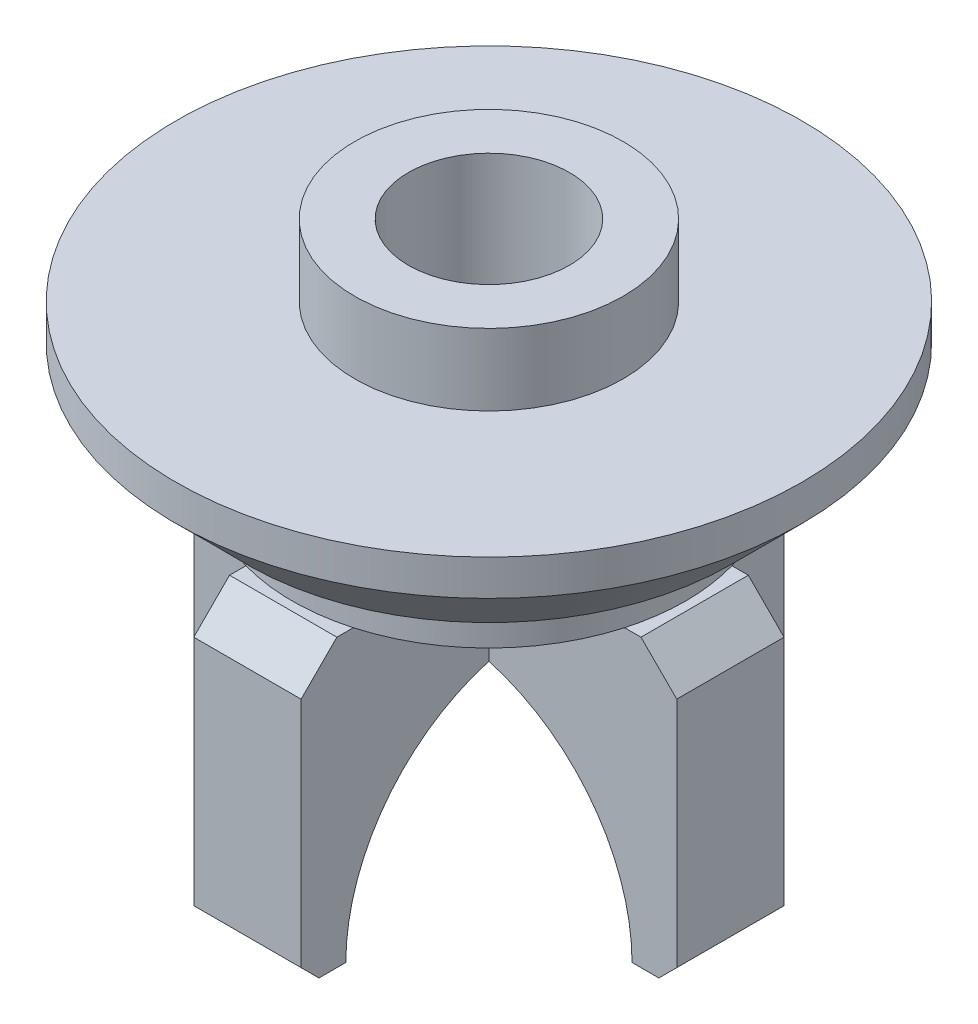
ISO-10303-21;
HEADER;
FILE_DESCRIPTION(('STEP AP214'),'2;1');
FILE_NAME('part.step','',(''),(''),'','','');
FILE_SCHEMA(('AUTOMOTIVE_DESIGN { 1 0 10303 214 1 1 1 1 }'));
ENDSEC;
DATA;
#1=APPLICATION_CONTEXT('core data for automotive mechanical design processes');
#2=APPLICATION_PROTOCOL_DEFINITION('international standard','automotive_design',2000,#1);
#3=PRODUCT_CONTEXT('',#1,'mechanical');
#4=PRODUCT('Part','Part','',(#3));
#5=PRODUCT_RELATED_PRODUCT_CATEGORY('part','',(#4));
#6=PRODUCT_DEFINITION_FORMATION('','',#4);
#7=PRODUCT_DEFINITION_CONTEXT('part definition',#1,'design');
#8=PRODUCT_DEFINITION('design','',#6,#7);
#9=PRODUCT_DEFINITION_SHAPE('','',#8);
#10=(LENGTH_UNIT() NAMED_UNIT(*) SI_UNIT(.MILLI.,.METRE.));
#11=(NAMED_UNIT(*) PLANE_ANGLE_UNIT() SI_UNIT($,.RADIAN.));
#12=(NAMED_UNIT(*) SI_UNIT($,.STERADIAN.) SOLID_ANGLE_UNIT());
#13=UNCERTAINTY_MEASURE_WITH_UNIT(LENGTH_MEASURE(1.E-05),#10,'distance_accuracy_value','');
#14=(GEOMETRIC_REPRESENTATION_CONTEXT(3) GLOBAL_UNCERTAINTY_ASSIGNED_CONTEXT((#13)) GLOBAL_UNIT_ASSIGNED_CONTEXT((#10,
#11,#12)) REPRESENTATION_CONTEXT('',''));
#15=CARTESIAN_POINT('',(0.,0.,0.));
#16=DIRECTION('',(0.,0.,1.));
#17=DIRECTION('',(1.,0.,0.));
#18=AXIS2_PLACEMENT_3D('',#15,#16,#17);
#19=CARTESIAN_POINT('',(0.,0.,0.));
#20=DIRECTION('',(0.,-1.,0.));
#21=DIRECTION('',(1.,0.,0.));
#22=AXIS2_PLACEMENT_3D('',#19,#20,#21);
#23=PLANE('',#22);
#24=CARTESIAN_POINT('',(0.,0.,0.));
#25=DIRECTION('',(0.,-1.,0.));
#26=DIRECTION('',(1.,0.,0.));
#27=AXIS2_PLACEMENT_3D('',#24,#25,#26);
#28=CIRCLE('',#27,11.);
#29=CARTESIAN_POINT('',(10.5830052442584,0.,3.));
#30=VERTEX_POINT('',#29);
#31=CARTESIAN_POINT('',(2.99999999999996,0.,10.5830052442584));
#32=VERTEX_POINT('',#31);
#33=EDGE_CURVE('E444',#30,#32,#28,.T.);
#34=ORIENTED_EDGE('',*,*,#33,.T.);
#35=DIRECTION('',(0.,0.,1.));
#36=VECTOR('',#35,1.);
#37=CARTESIAN_POINT('',(3.,0.,0.));
#38=LINE('',#37,#36);
#39=CARTESIAN_POINT('',(2.99999999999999,0.,3.));
#40=VERTEX_POINT('',#39);
#41=EDGE_CURVE('E493',#40,#32,#38,.T.);
#42=ORIENTED_EDGE('',*,*,#41,.F.);
#43=DIRECTION('',(1.,0.,0.));
#44=VECTOR('',#43,1.);
#45=CARTESIAN_POINT('',(0.,0.,3.));
#46=LINE('',#45,#44);
#47=EDGE_CURVE('E361',#40,#30,#46,.T.);
#48=ORIENTED_EDGE('',*,*,#47,.T.);
#49=EDGE_LOOP('',(#34,#42,#48));
#50=FACE_BOUND('',#49,.T.);
#51=ADVANCED_FACE('F38',(#50),#23,.T.);
#52=DIRECTION('',(1.,0.,0.));
#53=VECTOR('',#52,1.);
#54=CARTESIAN_POINT('',(0.,0.,-3.));
#55=LINE('',#54,#53);
#56=CARTESIAN_POINT('',(3.00000000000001,0.,-3.));
#57=VERTEX_POINT('',#56);
#58=CARTESIAN_POINT('',(10.5830052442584,0.,-3.));
#59=VERTEX_POINT('',#58);
#60=EDGE_CURVE('E390',#57,#59,#55,.T.);
#61=ORIENTED_EDGE('',*,*,#60,.F.);
#62=CARTESIAN_POINT('',(3.00000000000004,0.,-10.5830052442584));
#63=VERTEX_POINT('',#62);
#64=EDGE_CURVE('E61',#63,#57,#38,.T.);
#65=ORIENTED_EDGE('',*,*,#64,.F.);
#66=EDGE_CURVE('E447',#63,#59,#28,.T.);
#67=ORIENTED_EDGE('',*,*,#66,.T.);
#68=EDGE_LOOP('',(#61,#65,#67));
#69=FACE_BOUND('',#68,.T.);
#70=ADVANCED_FACE('F489',(#69),#23,.T.);
#71=CARTESIAN_POINT('',(0.,-16.,3.));
#72=DIRECTION('',(0.,0.,-1.));
#73=DIRECTION('',(-1.,0.,0.));
#74=AXIS2_PLACEMENT_3D('',#71,#72,#73);
#75=CYLINDRICAL_SURFACE('',#74,11.);
#76=CARTESIAN_POINT('',(0.,-16.,0.));
#77=DIRECTION('',(0.707106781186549,0.,-0.707106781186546));
#78=DIRECTION('',(-0.707106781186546,0.,-0.707106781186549));
#79=AXIS2_PLACEMENT_3D('',#76,#77,#78);
#80=ELLIPSE('',#79,15.5563491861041,11.);
#81=CARTESIAN_POINT('',(0.,-5.,0.));
#82=VERTEX_POINT('',#81);
#83=CARTESIAN_POINT('',(2.99999999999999,-5.41699475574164,3.));
#84=VERTEX_POINT('',#83);
#85=EDGE_CURVE('E336',#82,#84,#80,.T.);
#86=ORIENTED_EDGE('',*,*,#85,.F.);
#87=CARTESIAN_POINT('',(0.,-16.,0.));
#88=DIRECTION('',(-0.707106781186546,0.,-0.707106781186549));
#89=DIRECTION('',(0.707106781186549,0.,-0.707106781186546));
#90=AXIS2_PLACEMENT_3D('',#87,#88,#89);
#91=ELLIPSE('',#90,15.556349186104,11.);
#92=CARTESIAN_POINT('',(3.00000000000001,-5.41699475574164,-3.));
#93=VERTEX_POINT('',#92);
#94=EDGE_CURVE('E332',#93,#82,#91,.F.);
#95=ORIENTED_EDGE('',*,*,#94,.F.);
#96=CARTESIAN_POINT('',(0.,-16.,-3.));
#97=DIRECTION('',(0.,0.,1.));
#98=DIRECTION('',(1.,0.,0.));
#99=AXIS2_PLACEMENT_3D('',#96,#97,#98);
#100=CIRCLE('',#99,11.);
#101=CARTESIAN_POINT('',(11.,-16.,-3.));
#102=VERTEX_POINT('',#101);
#103=EDGE_CURVE('E372',#102,#93,#100,.T.);
#104=ORIENTED_EDGE('',*,*,#103,.F.);
#105=DIRECTION('',(0.,0.,-1.));
#106=VECTOR('',#105,1.);
#107=CARTESIAN_POINT('',(11.,-16.,3.));
#108=LINE('',#107,#106);
#109=CARTESIAN_POINT('',(11.,-16.,3.));
#110=VERTEX_POINT('',#109);
#111=EDGE_CURVE('E423',#110,#102,#108,.T.);
#112=ORIENTED_EDGE('',*,*,#111,.F.);
#113=CARTESIAN_POINT('',(0.,-16.,3.));
#114=DIRECTION('',(0.,0.,1.));
#115=DIRECTION('',(1.,0.,0.));
#116=AXIS2_PLACEMENT_3D('',#113,#114,#115);
#117=CIRCLE('',#116,11.);
#118=EDGE_CURVE('E342',#110,#84,#117,.T.);
#119=ORIENTED_EDGE('',*,*,#118,.T.);
#120=EDGE_LOOP('',(#86,#95,#104,#112,#119));
#121=FACE_BOUND('',#120,.T.);
#122=ADVANCED_FACE('F487',(#121),#75,.F.);
#123=CARTESIAN_POINT('',(0.,0.,3.));
#124=DIRECTION('',(0.,0.,1.));
#125=DIRECTION('',(1.,0.,0.));
#126=AXIS2_PLACEMENT_3D('',#123,#124,#125);
#127=PLANE('',#126);
#128=ORIENTED_EDGE('',*,*,#47,.F.);
#129=DIRECTION('',(0.,-1.,0.));
#130=VECTOR('',#129,1.);
#131=CARTESIAN_POINT('',(2.99999999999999,0.,3.));
#132=LINE('',#131,#130);
#133=EDGE_CURVE('E324',#40,#84,#132,.T.);
#134=ORIENTED_EDGE('',*,*,#133,.T.);
#135=ORIENTED_EDGE('',*,*,#118,.F.);
#136=DIRECTION('',(1.,0.,0.));
#137=VECTOR('',#136,1.);
#138=CARTESIAN_POINT('',(0.,-16.,3.));
#139=LINE('',#138,#137);
#140=CARTESIAN_POINT('',(12.5,-16.,3.));
#141=VERTEX_POINT('',#140);
#142=EDGE_CURVE('E345',#110,#141,#139,.T.);
#143=ORIENTED_EDGE('',*,*,#142,.T.);
#144=DIRECTION('',(0.707106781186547,0.707106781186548,0.));
#145=VECTOR('',#144,1.);
#146=CARTESIAN_POINT('',(14.25,-14.25,3.));
#147=LINE('',#146,#145);
#148=CARTESIAN_POINT('',(13.5,-15.,3.));
#149=VERTEX_POINT('',#148);
#150=EDGE_CURVE('E348',#141,#149,#147,.T.);
#151=ORIENTED_EDGE('',*,*,#150,.T.);
#152=DIRECTION('',(0.,-1.,0.));
#153=VECTOR('',#152,1.);
#154=CARTESIAN_POINT('',(13.5,0.,3.));
#155=LINE('',#154,#153);
#156=CARTESIAN_POINT('',(13.5,-2.,3.));
#157=VERTEX_POINT('',#156);
#158=EDGE_CURVE('E350',#157,#149,#155,.T.);
#159=ORIENTED_EDGE('',*,*,#158,.F.);
#160=DIRECTION('',(0.707106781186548,-0.707106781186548,0.));
#161=VECTOR('',#160,1.);
#162=CARTESIAN_POINT('',(5.75,5.75,3.));
#163=LINE('',#162,#161);
#164=CARTESIAN_POINT('',(11.5,0.,3.));
#165=VERTEX_POINT('',#164);
#166=EDGE_CURVE('E353',#165,#157,#163,.T.);
#167=ORIENTED_EDGE('',*,*,#166,.F.);
#168=EDGE_CURVE('E356',#30,#165,#46,.T.);
#169=ORIENTED_EDGE('',*,*,#168,.F.);
#170=EDGE_LOOP('',(#128,#134,#135,#143,#151,#159,#167,#169));
#171=FACE_BOUND('',#170,.T.);
#172=ADVANCED_FACE('F527',(#171),#127,.T.);
#173=CARTESIAN_POINT('',(0.,0.,-3.));
#174=DIRECTION('',(0.,0.,1.));
#175=DIRECTION('',(1.,0.,0.));
#176=AXIS2_PLACEMENT_3D('',#173,#174,#175);
#177=PLANE('',#176);
#178=DIRECTION('',(0.,-1.,0.));
#179=VECTOR('',#178,1.);
#180=CARTESIAN_POINT('',(3.00000000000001,0.,-3.));
#181=LINE('',#180,#179);
#182=EDGE_CURVE('E46',#57,#93,#181,.T.);
#183=ORIENTED_EDGE('',*,*,#182,.F.);
#184=ORIENTED_EDGE('',*,*,#60,.T.);
#185=CARTESIAN_POINT('',(11.5,0.,-3.));
#186=VERTEX_POINT('',#185);
#187=EDGE_CURVE('E385',#59,#186,#55,.T.);
#188=ORIENTED_EDGE('',*,*,#187,.T.);
#189=DIRECTION('',(0.707106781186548,-0.707106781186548,0.));
#190=VECTOR('',#189,1.);
#191=CARTESIAN_POINT('',(5.75,5.75,-3.));
#192=LINE('',#191,#190);
#193=CARTESIAN_POINT('',(13.5,-2.,-3.));
#194=VERTEX_POINT('',#193);
#195=EDGE_CURVE('E382',#186,#194,#192,.T.);
#196=ORIENTED_EDGE('',*,*,#195,.T.);
#197=DIRECTION('',(0.,-1.,0.));
#198=VECTOR('',#197,1.);
#199=CARTESIAN_POINT('',(13.5,0.,-3.));
#200=LINE('',#199,#198);
#201=CARTESIAN_POINT('',(13.5,-15.,-3.));
#202=VERTEX_POINT('',#201);
#203=EDGE_CURVE('E379',#194,#202,#200,.T.);
#204=ORIENTED_EDGE('',*,*,#203,.T.);
#205=DIRECTION('',(0.707106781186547,0.707106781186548,0.));
#206=VECTOR('',#205,1.);
#207=CARTESIAN_POINT('',(14.25,-14.25,-3.));
#208=LINE('',#207,#206);
#209=CARTESIAN_POINT('',(12.5,-16.,-3.));
#210=VERTEX_POINT('',#209);
#211=EDGE_CURVE('E376',#210,#202,#208,.T.);
#212=ORIENTED_EDGE('',*,*,#211,.F.);
#213=DIRECTION('',(1.,0.,0.));
#214=VECTOR('',#213,1.);
#215=CARTESIAN_POINT('',(0.,-16.,-3.));
#216=LINE('',#215,#214);
#217=EDGE_CURVE('E374',#102,#210,#216,.T.);
#218=ORIENTED_EDGE('',*,*,#217,.F.);
#219=ORIENTED_EDGE('',*,*,#103,.T.);
#220=EDGE_LOOP('',(#183,#184,#188,#196,#204,#212,#218,#219));
#221=FACE_BOUND('',#220,.T.);
#222=ADVANCED_FACE('F459',(#221),#177,.F.);
#223=DIRECTION('',(0.,0.,1.));
#224=VECTOR('',#223,1.);
#225=CARTESIAN_POINT('',(-3.,0.,0.));
#226=LINE('',#225,#224);
#227=CARTESIAN_POINT('',(-3.00000000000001,0.,3.));
#228=VERTEX_POINT('',#227);
#229=CARTESIAN_POINT('',(-3.00000000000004,0.,10.5830052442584));
#230=VERTEX_POINT('',#229);
#231=EDGE_CURVE('E533',#228,#230,#226,.T.);
#232=ORIENTED_EDGE('',*,*,#231,.T.);
#233=CARTESIAN_POINT('',(-10.5830052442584,0.,3.));
#234=VERTEX_POINT('',#233);
#235=EDGE_CURVE('E446',#230,#234,#28,.T.);
#236=ORIENTED_EDGE('',*,*,#235,.T.);
#237=EDGE_CURVE('E362',#234,#228,#46,.T.);
#238=ORIENTED_EDGE('',*,*,#237,.T.);
#239=EDGE_LOOP('',(#232,#236,#238));
#240=FACE_BOUND('',#239,.T.);
#241=ADVANCED_FACE('F532',(#240),#23,.T.);
#242=CARTESIAN_POINT('',(-2.99999999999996,0.,-10.5830052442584));
#243=VERTEX_POINT('',#242);
#244=CARTESIAN_POINT('',(-2.99999999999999,0.,-3.));
#245=VERTEX_POINT('',#244);
#246=EDGE_CURVE('E265',#243,#245,#226,.T.);
#247=ORIENTED_EDGE('',*,*,#246,.T.);
#248=CARTESIAN_POINT('',(-10.5830052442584,0.,-3.));
#249=VERTEX_POINT('',#248);
#250=EDGE_CURVE('E391',#249,#245,#55,.T.);
#251=ORIENTED_EDGE('',*,*,#250,.F.);
#252=EDGE_CURVE('E549',#249,#243,#28,.T.);
#253=ORIENTED_EDGE('',*,*,#252,.T.);
#254=EDGE_LOOP('',(#247,#251,#253));
#255=FACE_BOUND('',#254,.T.);
#256=ADVANCED_FACE('F40',(#255),#23,.T.);
#257=CARTESIAN_POINT('',(0.,0.,0.));
#258=DIRECTION('',(0.,-1.,0.));
#259=DIRECTION('',(1.,0.,0.));
#260=AXIS2_PLACEMENT_3D('',#257,#258,#259);
#261=CYLINDRICAL_SURFACE('',#260,11.);
#262=CARTESIAN_POINT('',(0.,3.,0.));
#263=DIRECTION('',(0.,-1.,0.));
#264=DIRECTION('',(1.,0.,0.));
#265=AXIS2_PLACEMENT_3D('',#262,#263,#264);
#266=CIRCLE('',#265,11.);
#267=CARTESIAN_POINT('',(11.,3.,0.));
#268=VERTEX_POINT('',#267);
#269=EDGE_CURVE('E440',#268,#268,#266,.T.);
#270=ORIENTED_EDGE('',*,*,#269,.T.);
#271=EDGE_LOOP('',(#270));
#272=FACE_BOUND('',#271,.T.);
#273=ORIENTED_EDGE('',*,*,#33,.F.);
#274=EDGE_CURVE('E443',#59,#30,#28,.T.);
#275=ORIENTED_EDGE('',*,*,#274,.F.);
#276=ORIENTED_EDGE('',*,*,#66,.F.);
#277=CARTESIAN_POINT('',(0.,0.,0.));
#278=DIRECTION('',(0.,1.,0.));
#279=DIRECTION('',(-1.,0.,0.));
#280=AXIS2_PLACEMENT_3D('',#277,#278,#279);
#281=CIRCLE('',#280,11.);
#282=EDGE_CURVE('E331',#243,#63,#281,.F.);
#283=ORIENTED_EDGE('',*,*,#282,.F.);
#284=ORIENTED_EDGE('',*,*,#252,.F.);
#285=EDGE_CURVE('E448',#234,#249,#28,.T.);
#286=ORIENTED_EDGE('',*,*,#285,.F.);
#287=ORIENTED_EDGE('',*,*,#235,.F.);
#288=EDGE_CURVE('E329',#32,#230,#281,.F.);
#289=ORIENTED_EDGE('',*,*,#288,.F.);
#290=EDGE_LOOP('',(#273,#275,#276,#283,#284,#286,#287,#289));
#291=FACE_BOUND('',#290,.T.);
#292=ADVANCED_FACE('F547',(#272,#291),#261,.T.);
#293=CARTESIAN_POINT('',(11.,3.,0.));
#294=DIRECTION('',(0.,-1.,0.));
#295=DIRECTION('',(1.,0.,0.));
#296=AXIS2_PLACEMENT_3D('',#293,#294,#295);
#297=PLANE('',#296);
#298=CARTESIAN_POINT('',(0.,3.,0.));
#299=DIRECTION('',(0.,-1.,0.));
#300=DIRECTION('',(1.,0.,0.));
#301=AXIS2_PLACEMENT_3D('',#298,#299,#300);
#302=CIRCLE('',#301,13.5);
#303=CARTESIAN_POINT('',(13.5,3.,0.));
#304=VERTEX_POINT('',#303);
#305=EDGE_CURVE('E437',#304,#304,#302,.T.);
#306=ORIENTED_EDGE('',*,*,#305,.T.);
#307=EDGE_LOOP('',(#306));
#308=FACE_BOUND('',#307,.T.);
#309=ORIENTED_EDGE('',*,*,#269,.F.);
#310=EDGE_LOOP('',(#309));
#311=FACE_BOUND('',#310,.T.);
#312=ADVANCED_FACE('F623',(#308,#311),#297,.T.);
#313=CARTESIAN_POINT('',(0.,3.,0.));
#314=DIRECTION('',(0.,1.,0.));
#315=DIRECTION('',(-1.,0.,0.));
#316=AXIS2_PLACEMENT_3D('',#313,#314,#315);
#317=CONICAL_SURFACE('',#316,13.5,0.785398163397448);
#318=CARTESIAN_POINT('',(0.,7.,0.));
#319=DIRECTION('',(0.,-1.,0.));
#320=DIRECTION('',(1.,0.,0.));
#321=AXIS2_PLACEMENT_3D('',#318,#319,#320);
#322=CIRCLE('',#321,17.5);
#323=CARTESIAN_POINT('',(17.5,7.,0.));
#324=VERTEX_POINT('',#323);
#325=EDGE_CURVE('E434',#324,#324,#322,.T.);
#326=ORIENTED_EDGE('',*,*,#325,.T.);
#327=EDGE_LOOP('',(#326));
#328=FACE_BOUND('',#327,.T.);
#329=ORIENTED_EDGE('',*,*,#305,.F.);
#330=EDGE_LOOP('',(#329));
#331=FACE_BOUND('',#330,.T.);
#332=ADVANCED_FACE('F693',(#328,#331),#317,.T.);
#333=CARTESIAN_POINT('',(0.,0.,0.));
#334=DIRECTION('',(0.,-1.,0.));
#335=DIRECTION('',(1.,0.,0.));
#336=AXIS2_PLACEMENT_3D('',#333,#334,#335);
#337=CYLINDRICAL_SURFACE('',#336,17.5);
#338=CARTESIAN_POINT('',(0.,9.,0.));
#339=DIRECTION('',(0.,-1.,0.));
#340=DIRECTION('',(1.,0.,0.));
#341=AXIS2_PLACEMENT_3D('',#338,#339,#340);
#342=CIRCLE('',#341,17.5);
#343=CARTESIAN_POINT('',(17.5,9.,0.));
#344=VERTEX_POINT('',#343);
#345=EDGE_CURVE('E431',#344,#344,#342,.T.);
#346=ORIENTED_EDGE('',*,*,#345,.T.);
#347=EDGE_LOOP('',(#346));
#348=FACE_BOUND('',#347,.T.);
#349=ORIENTED_EDGE('',*,*,#325,.F.);
#350=EDGE_LOOP('',(#349));
#351=FACE_BOUND('',#350,.T.);
#352=ADVANCED_FACE('F687',(#348,#351),#337,.T.);
#353=CARTESIAN_POINT('',(17.5,9.,0.));
#354=DIRECTION('',(0.,1.,0.));
#355=DIRECTION('',(-1.,0.,0.));
#356=AXIS2_PLACEMENT_3D('',#353,#354,#355);
#357=PLANE('',#356);
#358=CARTESIAN_POINT('',(0.,9.,0.));
#359=DIRECTION('',(0.,-1.,0.));
#360=DIRECTION('',(1.,0.,0.));
#361=AXIS2_PLACEMENT_3D('',#358,#359,#360);
#362=CIRCLE('',#361,7.5);
#363=CARTESIAN_POINT('',(7.5,9.,0.));
#364=VERTEX_POINT('',#363);
#365=EDGE_CURVE('E428',#364,#364,#362,.T.);
#366=ORIENTED_EDGE('',*,*,#365,.T.);
#367=EDGE_LOOP('',(#366));
#368=FACE_BOUND('',#367,.T.);
#369=ORIENTED_EDGE('',*,*,#345,.F.);
#370=EDGE_LOOP('',(#369));
#371=FACE_BOUND('',#370,.T.);
#372=ADVANCED_FACE('F681',(#368,#371),#357,.T.);
#373=CARTESIAN_POINT('',(0.,0.,0.));
#374=DIRECTION('',(0.,-1.,0.));
#375=DIRECTION('',(1.,0.,0.));
#376=AXIS2_PLACEMENT_3D('',#373,#374,#375);
#377=CYLINDRICAL_SURFACE('',#376,7.5);
#378=CARTESIAN_POINT('',(0.,13.,0.));
#379=DIRECTION('',(0.,-1.,0.));
#380=DIRECTION('',(1.,0.,0.));
#381=AXIS2_PLACEMENT_3D('',#378,#379,#380);
#382=CIRCLE('',#381,7.5);
#383=CARTESIAN_POINT('',(7.5,13.,0.));
#384=VERTEX_POINT('',#383);
#385=EDGE_CURVE('E425',#384,#384,#382,.T.);
#386=ORIENTED_EDGE('',*,*,#385,.T.);
#387=EDGE_LOOP('',(#386));
#388=FACE_BOUND('',#387,.T.);
#389=ORIENTED_EDGE('',*,*,#365,.F.);
#390=EDGE_LOOP('',(#389));
#391=FACE_BOUND('',#390,.T.);
#392=ADVANCED_FACE('F675',(#388,#391),#377,.T.);
#393=CARTESIAN_POINT('',(7.5,13.,0.));
#394=DIRECTION('',(0.,1.,0.));
#395=DIRECTION('',(-1.,0.,0.));
#396=AXIS2_PLACEMENT_3D('',#393,#394,#395);
#397=PLANE('',#396);
#398=CARTESIAN_POINT('',(0.,13.,0.));
#399=DIRECTION('',(0.,1.,0.));
#400=DIRECTION('',(0.,0.,1.));
#401=AXIS2_PLACEMENT_3D('',#398,#399,#400);
#402=CIRCLE('',#401,4.5);
#403=CARTESIAN_POINT('',(0.,13.,4.5));
#404=VERTEX_POINT('',#403);
#405=EDGE_CURVE('E240',#404,#404,#402,.T.);
#406=ORIENTED_EDGE('',*,*,#405,.F.);
#407=EDGE_LOOP('',(#406));
#408=FACE_BOUND('',#407,.T.);
#409=ORIENTED_EDGE('',*,*,#385,.F.);
#410=EDGE_LOOP('',(#409));
#411=FACE_BOUND('',#410,.T.);
#412=ADVANCED_FACE('F672',(#408,#411),#397,.T.);
#413=CARTESIAN_POINT('',(0.,0.,3.));
#414=DIRECTION('',(0.,1.,0.));
#415=DIRECTION('',(0.,0.,1.));
#416=AXIS2_PLACEMENT_3D('',#413,#414,#415);
#417=PLANE('',#416);
#418=CARTESIAN_POINT('',(-11.5,0.,3.));
#419=VERTEX_POINT('',#418);
#420=EDGE_CURVE('E357',#419,#234,#46,.T.);
#421=ORIENTED_EDGE('',*,*,#420,.T.);
#422=ORIENTED_EDGE('',*,*,#285,.T.);
#423=CARTESIAN_POINT('',(-11.5,0.,-3.));
#424=VERTEX_POINT('',#423);
#425=EDGE_CURVE('E386',#424,#249,#55,.T.);
#426=ORIENTED_EDGE('',*,*,#425,.F.);
#427=DIRECTION('',(0.,0.,-1.));
#428=VECTOR('',#427,1.);
#429=CARTESIAN_POINT('',(-11.5,0.,3.));
#430=LINE('',#429,#428);
#431=EDGE_CURVE('E411',#419,#424,#430,.T.);
#432=ORIENTED_EDGE('',*,*,#431,.F.);
#433=EDGE_LOOP('',(#421,#422,#426,#432));
#434=FACE_BOUND('',#433,.T.);
#435=ADVANCED_FACE('F542',(#434),#417,.T.);
#436=CARTESIAN_POINT('',(0.,-16.,0.));
#437=DIRECTION('',(0.707106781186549,0.,-0.707106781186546));
#438=DIRECTION('',(-0.707106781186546,0.,-0.707106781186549));
#439=AXIS2_PLACEMENT_3D('',#436,#437,#438);
#440=ELLIPSE('',#439,15.5563491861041,11.);
#441=CARTESIAN_POINT('',(-2.99999999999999,-5.41699475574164,-3.));
#442=VERTEX_POINT('',#441);
#443=EDGE_CURVE('E338',#82,#442,#440,.F.);
#444=ORIENTED_EDGE('',*,*,#443,.F.);
#445=CARTESIAN_POINT('',(0.,-16.,0.));
#446=DIRECTION('',(-0.707106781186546,0.,-0.707106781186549));
#447=DIRECTION('',(0.707106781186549,0.,-0.707106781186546));
#448=AXIS2_PLACEMENT_3D('',#445,#446,#447);
#449=ELLIPSE('',#448,15.556349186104,11.);
#450=CARTESIAN_POINT('',(-3.00000000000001,-5.41699475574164,3.));
#451=VERTEX_POINT('',#450);
#452=EDGE_CURVE('E53',#451,#82,#449,.T.);
#453=ORIENTED_EDGE('',*,*,#452,.F.);
#454=CARTESIAN_POINT('',(-11.,-16.,3.));
#455=VERTEX_POINT('',#454);
#456=EDGE_CURVE('E346',#451,#455,#117,.T.);
#457=ORIENTED_EDGE('',*,*,#456,.T.);
#458=DIRECTION('',(0.,0.,-1.));
#459=VECTOR('',#458,1.);
#460=CARTESIAN_POINT('',(-11.,-16.,3.));
#461=LINE('',#460,#459);
#462=CARTESIAN_POINT('',(-11.,-16.,-3.));
#463=VERTEX_POINT('',#462);
#464=EDGE_CURVE('E371',#455,#463,#461,.T.);
#465=ORIENTED_EDGE('',*,*,#464,.T.);
#466=EDGE_CURVE('E341',#442,#463,#100,.T.);
#467=ORIENTED_EDGE('',*,*,#466,.F.);
#468=EDGE_LOOP('',(#444,#453,#457,#465,#467));
#469=FACE_BOUND('',#468,.T.);
#470=ADVANCED_FACE('F585',(#469),#75,.F.);
#471=CARTESIAN_POINT('',(0.,-16.,3.));
#472=DIRECTION('',(0.,1.,0.));
#473=DIRECTION('',(0.,0.,1.));
#474=AXIS2_PLACEMENT_3D('',#471,#472,#473);
#475=PLANE('',#474);
#476=ORIENTED_EDGE('',*,*,#217,.T.);
#477=DIRECTION('',(0.,0.,-1.));
#478=VECTOR('',#477,1.);
#479=CARTESIAN_POINT('',(12.5,-16.,3.));
#480=LINE('',#479,#478);
#481=EDGE_CURVE('E420',#141,#210,#480,.T.);
#482=ORIENTED_EDGE('',*,*,#481,.F.);
#483=ORIENTED_EDGE('',*,*,#142,.F.);
#484=ORIENTED_EDGE('',*,*,#111,.T.);
#485=EDGE_LOOP('',(#476,#482,#483,#484));
#486=FACE_BOUND('',#485,.T.);
#487=ADVANCED_FACE('F484',(#486),#475,.F.);
#488=CARTESIAN_POINT('',(14.25,-14.25,3.));
#489=DIRECTION('',(-0.707106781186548,0.707106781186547,0.));
#490=DIRECTION('',(-0.707106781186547,-0.707106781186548,0.));
#491=AXIS2_PLACEMENT_3D('',#488,#489,#490);
#492=PLANE('',#491);
#493=ORIENTED_EDGE('',*,*,#211,.T.);
#494=DIRECTION('',(0.,0.,-1.));
#495=VECTOR('',#494,1.);
#496=CARTESIAN_POINT('',(13.5,-15.,3.));
#497=LINE('',#496,#495);
#498=EDGE_CURVE('E418',#149,#202,#497,.T.);
#499=ORIENTED_EDGE('',*,*,#498,.F.);
#500=ORIENTED_EDGE('',*,*,#150,.F.);
#501=ORIENTED_EDGE('',*,*,#481,.T.);
#502=EDGE_LOOP('',(#493,#499,#500,#501));
#503=FACE_BOUND('',#502,.T.);
#504=ADVANCED_FACE('F479',(#503),#492,.F.);
#505=CARTESIAN_POINT('',(13.5,0.,3.));
#506=DIRECTION('',(1.,0.,0.));
#507=DIRECTION('',(0.,0.,-1.));
#508=AXIS2_PLACEMENT_3D('',#505,#506,#507);
#509=PLANE('',#508);
#510=ORIENTED_EDGE('',*,*,#203,.F.);
#511=DIRECTION('',(0.,0.,-1.));
#512=VECTOR('',#511,1.);
#513=CARTESIAN_POINT('',(13.5,-2.,3.));
#514=LINE('',#513,#512);
#515=EDGE_CURVE('E416',#157,#194,#514,.T.);
#516=ORIENTED_EDGE('',*,*,#515,.F.);
#517=ORIENTED_EDGE('',*,*,#158,.T.);
#518=ORIENTED_EDGE('',*,*,#498,.T.);
#519=EDGE_LOOP('',(#510,#516,#517,#518));
#520=FACE_BOUND('',#519,.T.);
#521=ADVANCED_FACE('F473',(#520),#509,.T.);
#522=CARTESIAN_POINT('',(5.75,5.75,3.));
#523=DIRECTION('',(0.707106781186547,0.707106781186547,0.));
#524=DIRECTION('',(-0.707106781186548,0.707106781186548,0.));
#525=AXIS2_PLACEMENT_3D('',#522,#523,#524);
#526=PLANE('',#525);
#527=ORIENTED_EDGE('',*,*,#195,.F.);
#528=DIRECTION('',(0.,0.,-1.));
#529=VECTOR('',#528,1.);
#530=CARTESIAN_POINT('',(11.5,0.,3.));
#531=LINE('',#530,#529);
#532=EDGE_CURVE('E413',#165,#186,#531,.T.);
#533=ORIENTED_EDGE('',*,*,#532,.F.);
#534=ORIENTED_EDGE('',*,*,#166,.T.);
#535=ORIENTED_EDGE('',*,*,#515,.T.);
#536=EDGE_LOOP('',(#527,#533,#534,#535));
#537=FACE_BOUND('',#536,.T.);
#538=ADVANCED_FACE('F469',(#537),#526,.T.);
#539=ORIENTED_EDGE('',*,*,#187,.F.);
#540=ORIENTED_EDGE('',*,*,#274,.T.);
#541=ORIENTED_EDGE('',*,*,#168,.T.);
#542=ORIENTED_EDGE('',*,*,#532,.T.);
#543=EDGE_LOOP('',(#539,#540,#541,#542));
#544=FACE_BOUND('',#543,.T.);
#545=ADVANCED_FACE('F465',(#544),#417,.T.);
#546=CARTESIAN_POINT('',(-5.75,5.75,3.));
#547=DIRECTION('',(0.707106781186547,-0.707106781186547,0.));
#548=DIRECTION('',(0.707106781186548,0.707106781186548,0.));
#549=AXIS2_PLACEMENT_3D('',#546,#547,#548);
#550=PLANE('',#549);
#551=DIRECTION('',(-0.707106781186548,-0.707106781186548,0.));
#552=VECTOR('',#551,1.);
#553=CARTESIAN_POINT('',(-5.75,5.75,-3.));
#554=LINE('',#553,#552);
#555=CARTESIAN_POINT('',(-13.5,-2.,-3.));
#556=VERTEX_POINT('',#555);
#557=EDGE_CURVE('E389',#424,#556,#554,.T.);
#558=ORIENTED_EDGE('',*,*,#557,.T.);
#559=DIRECTION('',(0.,0.,-1.));
#560=VECTOR('',#559,1.);
#561=CARTESIAN_POINT('',(-13.5,-2.,3.));
#562=LINE('',#561,#560);
#563=CARTESIAN_POINT('',(-13.5,-2.,3.));
#564=VERTEX_POINT('',#563);
#565=EDGE_CURVE('E408',#564,#556,#562,.T.);
#566=ORIENTED_EDGE('',*,*,#565,.F.);
#567=DIRECTION('',(-0.707106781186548,-0.707106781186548,0.));
#568=VECTOR('',#567,1.);
#569=CARTESIAN_POINT('',(-5.75,5.75,3.));
#570=LINE('',#569,#568);
#571=EDGE_CURVE('E360',#419,#564,#570,.T.);
#572=ORIENTED_EDGE('',*,*,#571,.F.);
#573=ORIENTED_EDGE('',*,*,#431,.T.);
#574=EDGE_LOOP('',(#558,#566,#572,#573));
#575=FACE_BOUND('',#574,.T.);
#576=ADVANCED_FACE('F605',(#575),#550,.F.);
#577=CARTESIAN_POINT('',(-13.5,0.,3.));
#578=DIRECTION('',(1.,0.,0.));
#579=DIRECTION('',(0.,0.,-1.));
#580=AXIS2_PLACEMENT_3D('',#577,#578,#579);
#581=PLANE('',#580);
#582=DIRECTION('',(0.,-1.,0.));
#583=VECTOR('',#582,1.);
#584=CARTESIAN_POINT('',(-13.5,0.,-3.));
#585=LINE('',#584,#583);
#586=CARTESIAN_POINT('',(-13.5,-15.,-3.));
#587=VERTEX_POINT('',#586);
#588=EDGE_CURVE('E393',#556,#587,#585,.T.);
#589=ORIENTED_EDGE('',*,*,#588,.T.);
#590=DIRECTION('',(0.,0.,-1.));
#591=VECTOR('',#590,1.);
#592=CARTESIAN_POINT('',(-13.5,-15.,3.));
#593=LINE('',#592,#591);
#594=CARTESIAN_POINT('',(-13.5,-15.,3.));
#595=VERTEX_POINT('',#594);
#596=EDGE_CURVE('E405',#595,#587,#593,.T.);
#597=ORIENTED_EDGE('',*,*,#596,.F.);
#598=DIRECTION('',(0.,-1.,0.));
#599=VECTOR('',#598,1.);
#600=CARTESIAN_POINT('',(-13.5,0.,3.));
#601=LINE('',#600,#599);
#602=EDGE_CURVE('E364',#564,#595,#601,.T.);
#603=ORIENTED_EDGE('',*,*,#602,.F.);
#604=ORIENTED_EDGE('',*,*,#565,.T.);
#605=EDGE_LOOP('',(#589,#597,#603,#604));
#606=FACE_BOUND('',#605,.T.);
#607=ADVANCED_FACE('F601',(#606),#581,.F.);
#608=CARTESIAN_POINT('',(-14.25,-14.25,3.));
#609=DIRECTION('',(0.707106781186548,0.707106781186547,0.));
#610=DIRECTION('',(-0.707106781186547,0.707106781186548,0.));
#611=AXIS2_PLACEMENT_3D('',#608,#609,#610);
#612=PLANE('',#611);
#613=DIRECTION('',(0.707106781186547,-0.707106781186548,0.));
#614=VECTOR('',#613,1.);
#615=CARTESIAN_POINT('',(-14.25,-14.25,-3.));
#616=LINE('',#615,#614);
#617=CARTESIAN_POINT('',(-12.5,-16.,-3.));
#618=VERTEX_POINT('',#617);
#619=EDGE_CURVE('E395',#587,#618,#616,.T.);
#620=ORIENTED_EDGE('',*,*,#619,.T.);
#621=DIRECTION('',(0.,0.,-1.));
#622=VECTOR('',#621,1.);
#623=CARTESIAN_POINT('',(-12.5,-16.,3.));
#624=LINE('',#623,#622);
#625=CARTESIAN_POINT('',(-12.5,-16.,3.));
#626=VERTEX_POINT('',#625);
#627=EDGE_CURVE('E402',#626,#618,#624,.T.);
#628=ORIENTED_EDGE('',*,*,#627,.F.);
#629=DIRECTION('',(0.707106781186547,-0.707106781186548,0.));
#630=VECTOR('',#629,1.);
#631=CARTESIAN_POINT('',(-14.25,-14.25,3.));
#632=LINE('',#631,#630);
#633=EDGE_CURVE('E366',#595,#626,#632,.T.);
#634=ORIENTED_EDGE('',*,*,#633,.F.);
#635=ORIENTED_EDGE('',*,*,#596,.T.);
#636=EDGE_LOOP('',(#620,#628,#634,#635));
#637=FACE_BOUND('',#636,.T.);
#638=ADVANCED_FACE('F597',(#637),#612,.F.);
#639=CARTESIAN_POINT('',(0.,-16.,3.));
#640=DIRECTION('',(0.,1.,0.));
#641=DIRECTION('',(0.,0.,1.));
#642=AXIS2_PLACEMENT_3D('',#639,#640,#641);
#643=PLANE('',#642);
#644=DIRECTION('',(1.,0.,0.));
#645=VECTOR('',#644,1.);
#646=CARTESIAN_POINT('',(0.,-16.,-3.));
#647=LINE('',#646,#645);
#648=EDGE_CURVE('E397',#618,#463,#647,.T.);
#649=ORIENTED_EDGE('',*,*,#648,.T.);
#650=ORIENTED_EDGE('',*,*,#464,.F.);
#651=DIRECTION('',(1.,0.,0.));
#652=VECTOR('',#651,1.);
#653=CARTESIAN_POINT('',(0.,-16.,3.));
#654=LINE('',#653,#652);
#655=EDGE_CURVE('E368',#626,#455,#654,.T.);
#656=ORIENTED_EDGE('',*,*,#655,.F.);
#657=ORIENTED_EDGE('',*,*,#627,.T.);
#658=EDGE_LOOP('',(#649,#650,#656,#657));
#659=FACE_BOUND('',#658,.T.);
#660=ADVANCED_FACE('F592',(#659),#643,.F.);
#661=DIRECTION('',(0.,-1.,0.));
#662=VECTOR('',#661,1.);
#663=CARTESIAN_POINT('',(-3.00000000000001,0.,3.));
#664=LINE('',#663,#662);
#665=EDGE_CURVE('E327',#228,#451,#664,.T.);
#666=ORIENTED_EDGE('',*,*,#665,.F.);
#667=ORIENTED_EDGE('',*,*,#237,.F.);
#668=ORIENTED_EDGE('',*,*,#420,.F.);
#669=ORIENTED_EDGE('',*,*,#571,.T.);
#670=ORIENTED_EDGE('',*,*,#602,.T.);
#671=ORIENTED_EDGE('',*,*,#633,.T.);
#672=ORIENTED_EDGE('',*,*,#655,.T.);
#673=ORIENTED_EDGE('',*,*,#456,.F.);
#674=EDGE_LOOP('',(#666,#667,#668,#669,#670,#671,#672,#673));
#675=FACE_BOUND('',#674,.T.);
#676=ADVANCED_FACE('F538',(#675),#127,.T.);
#677=ORIENTED_EDGE('',*,*,#250,.T.);
#678=DIRECTION('',(0.,-1.,0.));
#679=VECTOR('',#678,1.);
#680=CARTESIAN_POINT('',(-2.99999999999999,0.,-3.));
#681=LINE('',#680,#679);
#682=EDGE_CURVE('E11',#245,#442,#681,.T.);
#683=ORIENTED_EDGE('',*,*,#682,.T.);
#684=ORIENTED_EDGE('',*,*,#466,.T.);
#685=ORIENTED_EDGE('',*,*,#648,.F.);
#686=ORIENTED_EDGE('',*,*,#619,.F.);
#687=ORIENTED_EDGE('',*,*,#588,.F.);
#688=ORIENTED_EDGE('',*,*,#557,.F.);
#689=ORIENTED_EDGE('',*,*,#425,.T.);
#690=EDGE_LOOP('',(#677,#683,#684,#685,#686,#687,#688,#689));
#691=FACE_BOUND('',#690,.T.);
#692=ADVANCED_FACE('F588',(#691),#177,.F.);
#693=CARTESIAN_POINT('',(-2.99999999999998,5.75,-5.75000000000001));
#694=DIRECTION('',(0.,-0.707106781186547,0.707106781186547));
#695=DIRECTION('',(0.,-0.707106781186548,-0.707106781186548));
#696=AXIS2_PLACEMENT_3D('',#693,#694,#695);
#697=PLANE('',#696);
#698=DIRECTION('',(0.,-0.707106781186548,-0.707106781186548));
#699=VECTOR('',#698,1.);
#700=CARTESIAN_POINT('',(3.00000000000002,5.75,-5.74999999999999));
#701=LINE('',#700,#699);
#702=CARTESIAN_POINT('',(3.00000000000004,0.,-11.5));
#703=VERTEX_POINT('',#702);
#704=CARTESIAN_POINT('',(3.00000000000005,-2.,-13.5));
#705=VERTEX_POINT('',#704);
#706=EDGE_CURVE('E290',#703,#705,#701,.T.);
#707=ORIENTED_EDGE('',*,*,#706,.T.);
#708=DIRECTION('',(1.,0.,0.));
#709=VECTOR('',#708,1.);
#710=CARTESIAN_POINT('',(-2.99999999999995,-2.,-13.5));
#711=LINE('',#710,#709);
#712=CARTESIAN_POINT('',(-2.99999999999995,-2.,-13.5));
#713=VERTEX_POINT('',#712);
#714=EDGE_CURVE('E307',#713,#705,#711,.T.);
#715=ORIENTED_EDGE('',*,*,#714,.F.);
#716=DIRECTION('',(0.,-0.707106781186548,-0.707106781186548));
#717=VECTOR('',#716,1.);
#718=CARTESIAN_POINT('',(-2.99999999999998,5.75,-5.75000000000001));
#719=LINE('',#718,#717);
#720=CARTESIAN_POINT('',(-2.99999999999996,0.,-11.5));
#721=VERTEX_POINT('',#720);
#722=EDGE_CURVE('E264',#721,#713,#719,.T.);
#723=ORIENTED_EDGE('',*,*,#722,.F.);
#724=DIRECTION('',(1.,0.,0.));
#725=VECTOR('',#724,1.);
#726=CARTESIAN_POINT('',(-2.99999999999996,0.,-11.5));
#727=LINE('',#726,#725);
#728=EDGE_CURVE('E310',#721,#703,#727,.T.);
#729=ORIENTED_EDGE('',*,*,#728,.T.);
#730=EDGE_LOOP('',(#707,#715,#723,#729));
#731=FACE_BOUND('',#730,.T.);
#732=ADVANCED_FACE('F564',(#731),#697,.F.);
#733=CARTESIAN_POINT('',(-2.99999999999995,0.,-13.5));
#734=DIRECTION('',(0.,0.,1.));
#735=DIRECTION('',(1.,0.,0.));
#736=AXIS2_PLACEMENT_3D('',#733,#734,#735);
#737=PLANE('',#736);
#738=DIRECTION('',(0.,-1.,0.));
#739=VECTOR('',#738,1.);
#740=CARTESIAN_POINT('',(3.00000000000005,0.,-13.5));
#741=LINE('',#740,#739);
#742=CARTESIAN_POINT('',(3.00000000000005,-15.,-13.5));
#743=VERTEX_POINT('',#742);
#744=EDGE_CURVE('E292',#705,#743,#741,.T.);
#745=ORIENTED_EDGE('',*,*,#744,.T.);
#746=DIRECTION('',(1.,0.,0.));
#747=VECTOR('',#746,1.);
#748=CARTESIAN_POINT('',(-2.99999999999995,-15.,-13.5));
#749=LINE('',#748,#747);
#750=CARTESIAN_POINT('',(-2.99999999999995,-15.,-13.5));
#751=VERTEX_POINT('',#750);
#752=EDGE_CURVE('E304',#751,#743,#749,.T.);
#753=ORIENTED_EDGE('',*,*,#752,.F.);
#754=DIRECTION('',(0.,-1.,0.));
#755=VECTOR('',#754,1.);
#756=CARTESIAN_POINT('',(-2.99999999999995,0.,-13.5));
#757=LINE('',#756,#755);
#758=EDGE_CURVE('E267',#713,#751,#757,.T.);
#759=ORIENTED_EDGE('',*,*,#758,.F.);
#760=ORIENTED_EDGE('',*,*,#714,.T.);
#761=EDGE_LOOP('',(#745,#753,#759,#760));
#762=FACE_BOUND('',#761,.T.);
#763=ADVANCED_FACE('F570',(#762),#737,.F.);
#764=CARTESIAN_POINT('',(-2.99999999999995,-14.25,-14.25));
#765=DIRECTION('',(0.,0.707106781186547,0.707106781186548));
#766=DIRECTION('',(0.,-0.707106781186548,0.707106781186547));
#767=AXIS2_PLACEMENT_3D('',#764,#765,#766);
#768=PLANE('',#767);
#769=DIRECTION('',(0.,-0.707106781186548,0.707106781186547));
#770=VECTOR('',#769,1.);
#771=CARTESIAN_POINT('',(3.00000000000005,-14.25,-14.25));
#772=LINE('',#771,#770);
#773=CARTESIAN_POINT('',(3.00000000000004,-16.,-12.5));
#774=VERTEX_POINT('',#773);
#775=EDGE_CURVE('E294',#743,#774,#772,.T.);
#776=ORIENTED_EDGE('',*,*,#775,.T.);
#777=DIRECTION('',(1.,0.,0.));
#778=VECTOR('',#777,1.);
#779=CARTESIAN_POINT('',(-2.99999999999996,-16.,-12.5));
#780=LINE('',#779,#778);
#781=CARTESIAN_POINT('',(-2.99999999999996,-16.,-12.5));
#782=VERTEX_POINT('',#781);
#783=EDGE_CURVE('E301',#782,#774,#780,.T.);
#784=ORIENTED_EDGE('',*,*,#783,.F.);
#785=DIRECTION('',(0.,-0.707106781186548,0.707106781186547));
#786=VECTOR('',#785,1.);
#787=CARTESIAN_POINT('',(-2.99999999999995,-14.25,-14.25));
#788=LINE('',#787,#786);
#789=EDGE_CURVE('E269',#751,#782,#788,.T.);
#790=ORIENTED_EDGE('',*,*,#789,.F.);
#791=ORIENTED_EDGE('',*,*,#752,.T.);
#792=EDGE_LOOP('',(#776,#784,#790,#791));
#793=FACE_BOUND('',#792,.T.);
#794=ADVANCED_FACE('F574',(#793),#768,.F.);
#795=CARTESIAN_POINT('',(-3.,-16.,0.));
#796=DIRECTION('',(0.,1.,0.));
#797=DIRECTION('',(-1.,0.,0.));
#798=AXIS2_PLACEMENT_3D('',#795,#796,#797);
#799=PLANE('',#798);
#800=DIRECTION('',(0.,0.,1.));
#801=VECTOR('',#800,1.);
#802=CARTESIAN_POINT('',(3.,-16.,0.));
#803=LINE('',#802,#801);
#804=CARTESIAN_POINT('',(3.00000000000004,-16.,-11.));
#805=VERTEX_POINT('',#804);
#806=EDGE_CURVE('E296',#774,#805,#803,.T.);
#807=ORIENTED_EDGE('',*,*,#806,.T.);
#808=DIRECTION('',(1.,0.,0.));
#809=VECTOR('',#808,1.);
#810=CARTESIAN_POINT('',(-2.99999999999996,-16.,-11.));
#811=LINE('',#810,#809);
#812=CARTESIAN_POINT('',(-2.99999999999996,-16.,-11.));
#813=VERTEX_POINT('',#812);
#814=EDGE_CURVE('E273',#813,#805,#811,.T.);
#815=ORIENTED_EDGE('',*,*,#814,.F.);
#816=DIRECTION('',(0.,0.,1.));
#817=VECTOR('',#816,1.);
#818=CARTESIAN_POINT('',(-3.,-16.,0.));
#819=LINE('',#818,#817);
#820=EDGE_CURVE('E271',#782,#813,#819,.T.);
#821=ORIENTED_EDGE('',*,*,#820,.F.);
#822=ORIENTED_EDGE('',*,*,#783,.T.);
#823=EDGE_LOOP('',(#807,#815,#821,#822));
#824=FACE_BOUND('',#823,.T.);
#825=ADVANCED_FACE('F579',(#824),#799,.F.);
#826=CARTESIAN_POINT('',(3.,0.,0.));
#827=DIRECTION('',(-1.,0.,0.));
#828=DIRECTION('',(0.,0.,1.));
#829=AXIS2_PLACEMENT_3D('',#826,#827,#828);
#830=PLANE('',#829);
#831=ORIENTED_EDGE('',*,*,#64,.T.);
#832=ORIENTED_EDGE('',*,*,#182,.T.);
#833=CARTESIAN_POINT('',(3.,-16.,0.));
#834=DIRECTION('',(-1.,0.,0.));
#835=DIRECTION('',(0.,0.,1.));
#836=AXIS2_PLACEMENT_3D('',#833,#834,#835);
#837=CIRCLE('',#836,11.);
#838=EDGE_CURVE('E239',#93,#805,#837,.T.);
#839=ORIENTED_EDGE('',*,*,#838,.T.);
#840=ORIENTED_EDGE('',*,*,#806,.F.);
#841=ORIENTED_EDGE('',*,*,#775,.F.);
#842=ORIENTED_EDGE('',*,*,#744,.F.);
#843=ORIENTED_EDGE('',*,*,#706,.F.);
#844=EDGE_CURVE('E287',#703,#63,#38,.T.);
#845=ORIENTED_EDGE('',*,*,#844,.T.);
#846=EDGE_LOOP('',(#831,#832,#839,#840,#841,#842,#843,#845));
#847=FACE_BOUND('',#846,.T.);
#848=ADVANCED_FACE('F490',(#847),#830,.F.);
#849=CARTESIAN_POINT('',(-3.,0.,0.));
#850=DIRECTION('',(-1.,0.,0.));
#851=DIRECTION('',(0.,0.,1.));
#852=AXIS2_PLACEMENT_3D('',#849,#850,#851);
#853=PLANE('',#852);
#854=ORIENTED_EDGE('',*,*,#682,.F.);
#855=ORIENTED_EDGE('',*,*,#246,.F.);
#856=EDGE_CURVE('E261',#721,#243,#226,.T.);
#857=ORIENTED_EDGE('',*,*,#856,.F.);
#858=ORIENTED_EDGE('',*,*,#722,.T.);
#859=ORIENTED_EDGE('',*,*,#758,.T.);
#860=ORIENTED_EDGE('',*,*,#789,.T.);
#861=ORIENTED_EDGE('',*,*,#820,.T.);
#862=CARTESIAN_POINT('',(-3.,-16.,0.));
#863=DIRECTION('',(-1.,0.,0.));
#864=DIRECTION('',(0.,0.,1.));
#865=AXIS2_PLACEMENT_3D('',#862,#863,#864);
#866=CIRCLE('',#865,11.);
#867=EDGE_CURVE('E250',#442,#813,#866,.T.);
#868=ORIENTED_EDGE('',*,*,#867,.F.);
#869=EDGE_LOOP('',(#854,#855,#857,#858,#859,#860,#861,#868));
#870=FACE_BOUND('',#869,.T.);
#871=ADVANCED_FACE('F556',(#870),#853,.T.);
#872=CARTESIAN_POINT('',(-3.,-16.,0.));
#873=DIRECTION('',(1.,0.,0.));
#874=DIRECTION('',(0.,0.,-1.));
#875=AXIS2_PLACEMENT_3D('',#872,#873,#874);
#876=CYLINDRICAL_SURFACE('',#875,11.);
#877=ORIENTED_EDGE('',*,*,#94,.T.);
#878=ORIENTED_EDGE('',*,*,#443,.T.);
#879=ORIENTED_EDGE('',*,*,#867,.T.);
#880=ORIENTED_EDGE('',*,*,#814,.T.);
#881=ORIENTED_EDGE('',*,*,#838,.F.);
#882=EDGE_LOOP('',(#877,#878,#879,#880,#881));
#883=FACE_BOUND('',#882,.T.);
#884=ADVANCED_FACE('F581',(#883),#876,.F.);
#885=CARTESIAN_POINT('',(-3.,0.,0.));
#886=DIRECTION('',(0.,1.,0.));
#887=DIRECTION('',(-1.,0.,0.));
#888=AXIS2_PLACEMENT_3D('',#885,#886,#887);
#889=PLANE('',#888);
#890=ORIENTED_EDGE('',*,*,#856,.T.);
#891=ORIENTED_EDGE('',*,*,#282,.T.);
#892=ORIENTED_EDGE('',*,*,#844,.F.);
#893=ORIENTED_EDGE('',*,*,#728,.F.);
#894=EDGE_LOOP('',(#890,#891,#892,#893));
#895=FACE_BOUND('',#894,.T.);
#896=ADVANCED_FACE('F560',(#895),#889,.T.);
#897=ORIENTED_EDGE('',*,*,#452,.T.);
#898=ORIENTED_EDGE('',*,*,#85,.T.);
#899=CARTESIAN_POINT('',(2.99999999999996,-16.,11.));
#900=VERTEX_POINT('',#899);
#901=EDGE_CURVE('E242',#900,#84,#837,.T.);
#902=ORIENTED_EDGE('',*,*,#901,.F.);
#903=DIRECTION('',(1.,0.,0.));
#904=VECTOR('',#903,1.);
#905=CARTESIAN_POINT('',(-3.00000000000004,-16.,11.));
#906=LINE('',#905,#904);
#907=CARTESIAN_POINT('',(-3.00000000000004,-16.,11.));
#908=VERTEX_POINT('',#907);
#909=EDGE_CURVE('E322',#908,#900,#906,.T.);
#910=ORIENTED_EDGE('',*,*,#909,.F.);
#911=EDGE_CURVE('E247',#908,#451,#866,.T.);
#912=ORIENTED_EDGE('',*,*,#911,.T.);
#913=EDGE_LOOP('',(#897,#898,#902,#910,#912));
#914=FACE_BOUND('',#913,.T.);
#915=ADVANCED_FACE('F522',(#914),#876,.F.);
#916=CARTESIAN_POINT('',(-3.,-16.,0.));
#917=DIRECTION('',(0.,1.,0.));
#918=DIRECTION('',(-1.,0.,0.));
#919=AXIS2_PLACEMENT_3D('',#916,#917,#918);
#920=PLANE('',#919);
#921=DIRECTION('',(0.,0.,1.));
#922=VECTOR('',#921,1.);
#923=CARTESIAN_POINT('',(3.,-16.,0.));
#924=LINE('',#923,#922);
#925=CARTESIAN_POINT('',(2.99999999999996,-16.,12.5));
#926=VERTEX_POINT('',#925);
#927=EDGE_CURVE('E275',#900,#926,#924,.T.);
#928=ORIENTED_EDGE('',*,*,#927,.T.);
#929=DIRECTION('',(1.,0.,0.));
#930=VECTOR('',#929,1.);
#931=CARTESIAN_POINT('',(-3.00000000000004,-16.,12.5));
#932=LINE('',#931,#930);
#933=CARTESIAN_POINT('',(-3.00000000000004,-16.,12.5));
#934=VERTEX_POINT('',#933);
#935=EDGE_CURVE('E319',#934,#926,#932,.T.);
#936=ORIENTED_EDGE('',*,*,#935,.F.);
#937=DIRECTION('',(0.,0.,1.));
#938=VECTOR('',#937,1.);
#939=CARTESIAN_POINT('',(-3.,-16.,0.));
#940=LINE('',#939,#938);
#941=EDGE_CURVE('E249',#908,#934,#940,.T.);
#942=ORIENTED_EDGE('',*,*,#941,.F.);
#943=ORIENTED_EDGE('',*,*,#909,.T.);
#944=EDGE_LOOP('',(#928,#936,#942,#943));
#945=FACE_BOUND('',#944,.T.);
#946=ADVANCED_FACE('F520',(#945),#920,.F.);
#947=CARTESIAN_POINT('',(-3.00000000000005,-14.25,14.25));
#948=DIRECTION('',(0.,0.707106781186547,-0.707106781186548));
#949=DIRECTION('',(0.,0.707106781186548,0.707106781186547));
#950=AXIS2_PLACEMENT_3D('',#947,#948,#949);
#951=PLANE('',#950);
#952=DIRECTION('',(0.,0.707106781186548,0.707106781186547));
#953=VECTOR('',#952,1.);
#954=CARTESIAN_POINT('',(2.99999999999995,-14.25,14.25));
#955=LINE('',#954,#953);
#956=CARTESIAN_POINT('',(2.99999999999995,-15.,13.5));
#957=VERTEX_POINT('',#956);
#958=EDGE_CURVE('E277',#926,#957,#955,.T.);
#959=ORIENTED_EDGE('',*,*,#958,.T.);
#960=DIRECTION('',(1.,0.,0.));
#961=VECTOR('',#960,1.);
#962=CARTESIAN_POINT('',(-3.00000000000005,-15.,13.5));
#963=LINE('',#962,#961);
#964=CARTESIAN_POINT('',(-3.00000000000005,-15.,13.5));
#965=VERTEX_POINT('',#964);
#966=EDGE_CURVE('E317',#965,#957,#963,.T.);
#967=ORIENTED_EDGE('',*,*,#966,.F.);
#968=DIRECTION('',(0.,0.707106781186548,0.707106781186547));
#969=VECTOR('',#968,1.);
#970=CARTESIAN_POINT('',(-3.00000000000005,-14.25,14.25));
#971=LINE('',#970,#969);
#972=EDGE_CURVE('E252',#934,#965,#971,.T.);
#973=ORIENTED_EDGE('',*,*,#972,.F.);
#974=ORIENTED_EDGE('',*,*,#935,.T.);
#975=EDGE_LOOP('',(#959,#967,#973,#974));
#976=FACE_BOUND('',#975,.T.);
#977=ADVANCED_FACE('F515',(#976),#951,.F.);
#978=CARTESIAN_POINT('',(-3.00000000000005,0.,13.5));
#979=DIRECTION('',(0.,0.,1.));
#980=DIRECTION('',(1.,0.,0.));
#981=AXIS2_PLACEMENT_3D('',#978,#979,#980);
#982=PLANE('',#981);
#983=DIRECTION('',(0.,-1.,0.));
#984=VECTOR('',#983,1.);
#985=CARTESIAN_POINT('',(2.99999999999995,0.,13.5));
#986=LINE('',#985,#984);
#987=CARTESIAN_POINT('',(2.99999999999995,-2.,13.5));
#988=VERTEX_POINT('',#987);
#989=EDGE_CURVE('E280',#988,#957,#986,.T.);
#990=ORIENTED_EDGE('',*,*,#989,.F.);
#991=DIRECTION('',(1.,0.,0.));
#992=VECTOR('',#991,1.);
#993=CARTESIAN_POINT('',(-3.00000000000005,-2.,13.5));
#994=LINE('',#993,#992);
#995=CARTESIAN_POINT('',(-3.00000000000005,-2.,13.5));
#996=VERTEX_POINT('',#995);
#997=EDGE_CURVE('E315',#996,#988,#994,.T.);
#998=ORIENTED_EDGE('',*,*,#997,.F.);
#999=DIRECTION('',(0.,-1.,0.));
#1000=VECTOR('',#999,1.);
#1001=CARTESIAN_POINT('',(-3.00000000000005,0.,13.5));
#1002=LINE('',#1001,#1000);
#1003=EDGE_CURVE('E254',#996,#965,#1002,.T.);
#1004=ORIENTED_EDGE('',*,*,#1003,.T.);
#1005=ORIENTED_EDGE('',*,*,#966,.T.);
#1006=EDGE_LOOP('',(#990,#998,#1004,#1005));
#1007=FACE_BOUND('',#1006,.T.);
#1008=ADVANCED_FACE('F509',(#1007),#982,.T.);
#1009=CARTESIAN_POINT('',(-3.00000000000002,5.75,5.74999999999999));
#1010=DIRECTION('',(0.,0.707106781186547,0.707106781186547));
#1011=DIRECTION('',(0.,-0.707106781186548,0.707106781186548));
#1012=AXIS2_PLACEMENT_3D('',#1009,#1010,#1011);
#1013=PLANE('',#1012);
#1014=DIRECTION('',(0.,-0.707106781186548,0.707106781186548));
#1015=VECTOR('',#1014,1.);
#1016=CARTESIAN_POINT('',(2.99999999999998,5.75,5.75000000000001));
#1017=LINE('',#1016,#1015);
#1018=CARTESIAN_POINT('',(2.99999999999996,0.,11.5));
#1019=VERTEX_POINT('',#1018);
#1020=EDGE_CURVE('E283',#1019,#988,#1017,.T.);
#1021=ORIENTED_EDGE('',*,*,#1020,.F.);
#1022=DIRECTION('',(1.,0.,0.));
#1023=VECTOR('',#1022,1.);
#1024=CARTESIAN_POINT('',(-3.00000000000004,0.,11.5));
#1025=LINE('',#1024,#1023);
#1026=CARTESIAN_POINT('',(-3.00000000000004,0.,11.5));
#1027=VERTEX_POINT('',#1026);
#1028=EDGE_CURVE('E312',#1027,#1019,#1025,.T.);
#1029=ORIENTED_EDGE('',*,*,#1028,.F.);
#1030=DIRECTION('',(0.,-0.707106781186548,0.707106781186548));
#1031=VECTOR('',#1030,1.);
#1032=CARTESIAN_POINT('',(-3.00000000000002,5.75,5.74999999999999));
#1033=LINE('',#1032,#1031);
#1034=EDGE_CURVE('E257',#1027,#996,#1033,.T.);
#1035=ORIENTED_EDGE('',*,*,#1034,.T.);
#1036=ORIENTED_EDGE('',*,*,#997,.T.);
#1037=EDGE_LOOP('',(#1021,#1029,#1035,#1036));
#1038=FACE_BOUND('',#1037,.T.);
#1039=ADVANCED_FACE('F505',(#1038),#1013,.T.);
#1040=EDGE_CURVE('E286',#32,#1019,#38,.T.);
#1041=ORIENTED_EDGE('',*,*,#1040,.F.);
#1042=ORIENTED_EDGE('',*,*,#288,.T.);
#1043=EDGE_CURVE('E260',#230,#1027,#226,.T.);
#1044=ORIENTED_EDGE('',*,*,#1043,.T.);
#1045=ORIENTED_EDGE('',*,*,#1028,.T.);
#1046=EDGE_LOOP('',(#1041,#1042,#1044,#1045));
#1047=FACE_BOUND('',#1046,.T.);
#1048=ADVANCED_FACE('F501',(#1047),#889,.T.);
#1049=ORIENTED_EDGE('',*,*,#231,.F.);
#1050=ORIENTED_EDGE('',*,*,#665,.T.);
#1051=ORIENTED_EDGE('',*,*,#911,.F.);
#1052=ORIENTED_EDGE('',*,*,#941,.T.);
#1053=ORIENTED_EDGE('',*,*,#972,.T.);
#1054=ORIENTED_EDGE('',*,*,#1003,.F.);
#1055=ORIENTED_EDGE('',*,*,#1034,.F.);
#1056=ORIENTED_EDGE('',*,*,#1043,.F.);
#1057=EDGE_LOOP('',(#1049,#1050,#1051,#1052,#1053,#1054,#1055,#1056));
#1058=FACE_BOUND('',#1057,.T.);
#1059=ADVANCED_FACE('F553',(#1058),#853,.T.);
#1060=ORIENTED_EDGE('',*,*,#133,.F.);
#1061=ORIENTED_EDGE('',*,*,#41,.T.);
#1062=ORIENTED_EDGE('',*,*,#1040,.T.);
#1063=ORIENTED_EDGE('',*,*,#1020,.T.);
#1064=ORIENTED_EDGE('',*,*,#989,.T.);
#1065=ORIENTED_EDGE('',*,*,#958,.F.);
#1066=ORIENTED_EDGE('',*,*,#927,.F.);
#1067=ORIENTED_EDGE('',*,*,#901,.T.);
#1068=EDGE_LOOP('',(#1060,#1061,#1062,#1063,#1064,#1065,#1066,#1067));
#1069=FACE_BOUND('',#1068,.T.);
#1070=ADVANCED_FACE('F233',(#1069),#830,.F.);
#1071=CARTESIAN_POINT('',(0.,3.,0.));
#1072=DIRECTION('',(0.,1.,0.));
#1073=DIRECTION('',(0.,0.,1.));
#1074=AXIS2_PLACEMENT_3D('',#1071,#1072,#1073);
#1075=CONICAL_SURFACE('',#1074,4.5,1.02974425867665);
#1076=CARTESIAN_POINT('',(0.,0.296127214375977,0.));
#1077=VERTEX_POINT('',#1076);
#1078=VERTEX_LOOP('',#1077);
#1079=FACE_BOUND('',#1078,.T.);
#1080=CARTESIAN_POINT('',(0.,3.,0.));
#1081=DIRECTION('',(0.,1.,0.));
#1082=DIRECTION('',(0.,0.,1.));
#1083=AXIS2_PLACEMENT_3D('',#1080,#1081,#1082);
#1084=CIRCLE('',#1083,4.5);
#1085=CARTESIAN_POINT('',(0.,3.,4.5));
#1086=VERTEX_POINT('',#1085);
#1087=EDGE_CURVE('E237',#1086,#1086,#1084,.T.);
#1088=ORIENTED_EDGE('',*,*,#1087,.T.);
#1089=EDGE_LOOP('',(#1088));
#1090=FACE_BOUND('',#1089,.T.);
#1091=ADVANCED_FACE('F229',(#1079,#1090),#1075,.F.);
#1092=CARTESIAN_POINT('',(0.,13.,0.));
#1093=DIRECTION('',(0.,1.,0.));
#1094=DIRECTION('',(0.,0.,1.));
#1095=AXIS2_PLACEMENT_3D('',#1092,#1093,#1094);
#1096=CYLINDRICAL_SURFACE('',#1095,4.5);
#1097=ORIENTED_EDGE('',*,*,#1087,.F.);
#1098=EDGE_LOOP('',(#1097));
#1099=FACE_BOUND('',#1098,.T.);
#1100=ORIENTED_EDGE('',*,*,#405,.T.);
#1101=EDGE_LOOP('',(#1100));
#1102=FACE_BOUND('',#1101,.T.);
#1103=ADVANCED_FACE('F232',(#1099,#1102),#1096,.F.);
#1104=CLOSED_SHELL('',(#51,#70,#122,#172,#222,#241,#256,#292,#312,#332,#352,#372,#392,#412,#435,
#470,#487,#504,#521,#538,#545,#576,#607,#638,#660,#676,#692,#732,#763,#794,#825,#848,#871,#884,
#896,#915,#946,#977,#1008,#1039,#1048,#1059,#1070,#1091,#1103));
#1105=MANIFOLD_SOLID_BREP('B2',#1104);
#1106=ADVANCED_BREP_SHAPE_REPRESENTATION('',(#18,#1105),#14);
#1107=SHAPE_DEFINITION_REPRESENTATION(#9,#1106);
ENDSEC;
END-ISO-10303-21;
